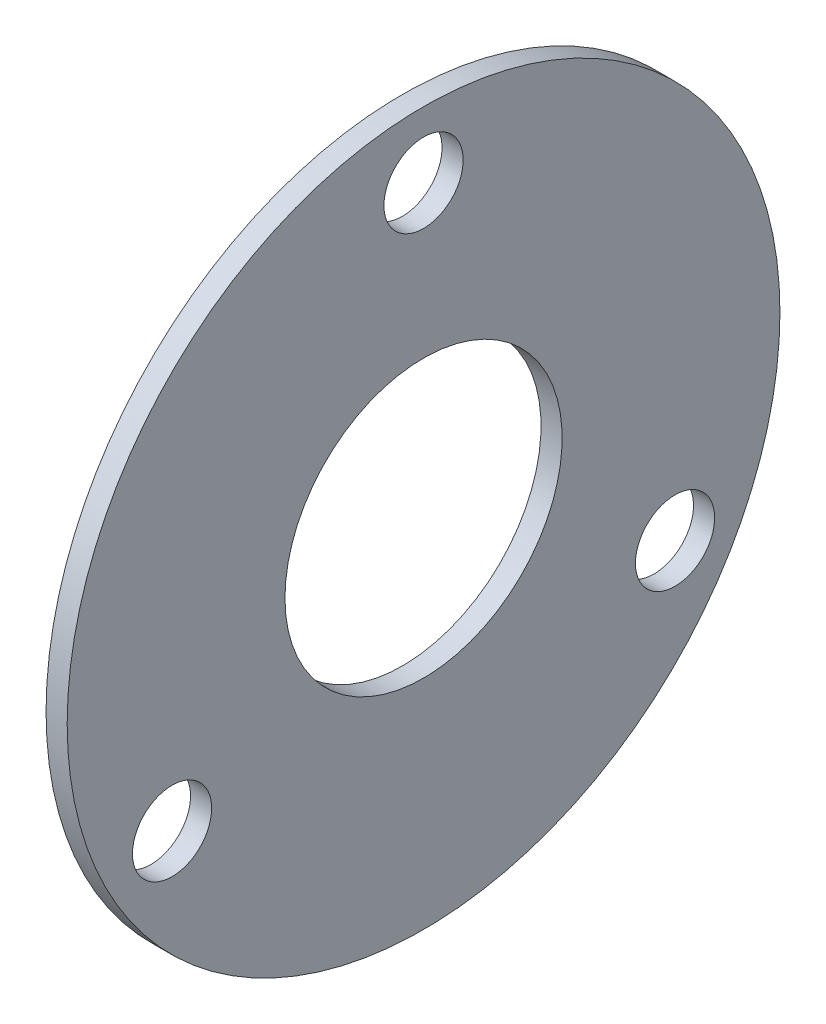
from build123d import *

# Parameters (mm, degrees)
ESQUISSE2_R                  = 13.5
EXTRUSION1_DEPTH             = 0.8
ESQUISSE3_R                  = 1.5
ENL_V_MAT_EXTRU_1_DEPTH      = 20.108636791
R_P_TITION_CIRCULAIRE1_COUNT = 3
ESQUISSE4_R                  = 5.25
ENL_V_MAT_EXTRU_2_DEPTH      = 20.108636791


with BuildPart() as part:
    # Esquisse2 → Extrusion1 (new body)
    with BuildSketch(Plane.ZY.offset(7.3)):
        Circle(ESQUISSE2_R)
    extrude(amount=EXTRUSION1_DEPTH)

    # Esquisse3 → Enl_v. mat.-Extru.1 (cut, through all)
    with BuildSketch(Plane.ZY.offset(8.1)):
        with Locations((0, 11)):
            Circle(ESQUISSE3_R)
    enl_v_mat_extru_1 = extrude(amount=-ENL_V_MAT_EXTRU_1_DEPTH, mode=Mode.SUBTRACT)

    # R_p_tition circulaire1: Enl_v. mat.-Extru.1 ×3 about axis
    r_p_tition_circulaire1_axis = Axis((0, 0, 0), (1, 0, 0))
    for i in range(1, R_P_TITION_CIRCULAIRE1_COUNT):
        add(enl_v_mat_extru_1.rotate(r_p_tition_circulaire1_axis, i * 360 / R_P_TITION_CIRCULAIRE1_COUNT), mode=Mode.SUBTRACT)

    # Esquisse4 → Enl_v. mat.-Extru.2 (cut, through all)
    with BuildSketch(Plane.ZY.offset(8.1)):
        Circle(ESQUISSE4_R)
    extrude(amount=-ENL_V_MAT_EXTRU_2_DEPTH, mode=Mode.SUBTRACT)


solid = part.part
